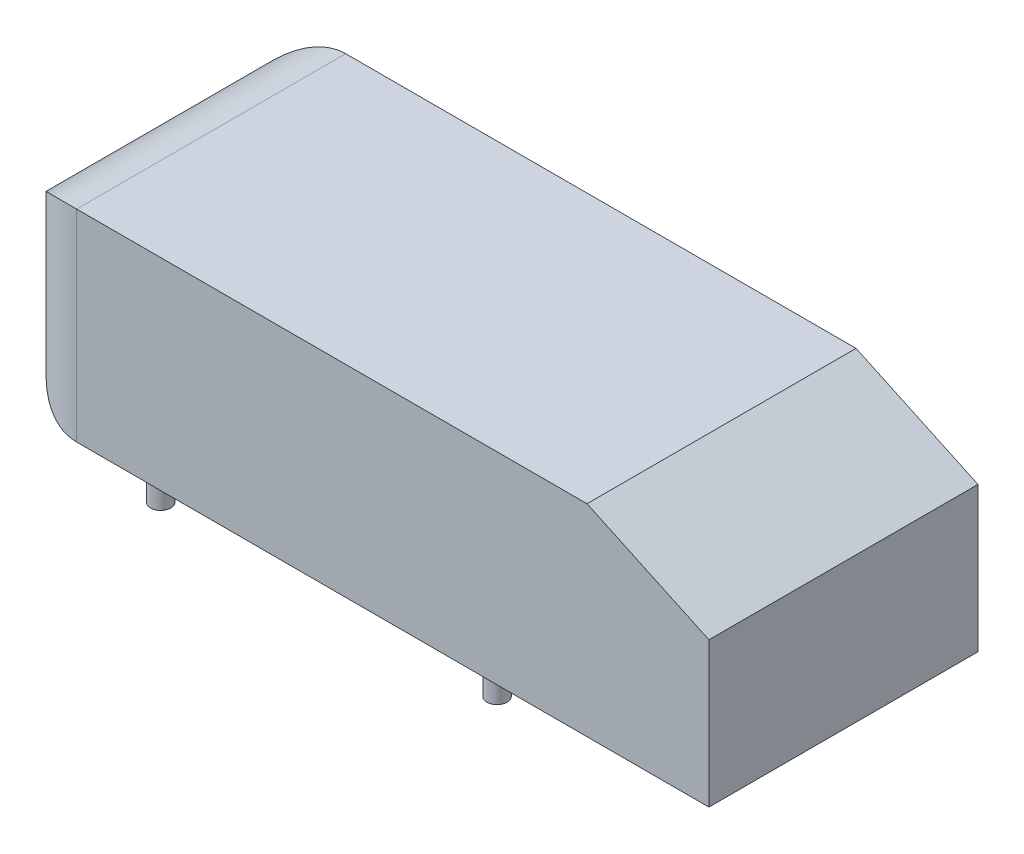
from build123d import *

# Parameters (mm, degrees)
SKETCH3_W               = 400
SKETCH3_H               = 300
BOSS_EXTRUDE1_DEPTH     = 1050
FILLET1_R               = 110
CUT_EXTRUDE1_DEPTH      = 1125.72218792
CUT_EXTRUDE1_DEPTH_BACK = 1125.72218792
SKETCH6_R               = 15
BOSS_EXTRUDE2_DEPTH     = 50


with BuildPart() as part:
    # Sketch3 → Boss-Extrude1 (new body)
    with BuildSketch(Plane(origin=(0, 0, 0), x_dir=(0, 0, -1), z_dir=(1, 0, 0))):
        with Locations((0, 200)):
            Rectangle(SKETCH3_W, SKETCH3_H)
    extrude(amount=-BOSS_EXTRUDE1_DEPTH)

    # Fillet1
    fillet1_edges = [part.edges().sort_by_distance(p)[0] for p in [
        (-1050, 200, -200),
        (-1050, 350, 0),
        (-1050, 200, 200),
        (-1050, 50, 0),
    ]]
    fillet(fillet1_edges, radius=FILLET1_R)

    # Sketch4 → Cut-Extrude1 (cut, two sides: drawn at the far end of the back side and taken through both)
    with BuildSketch(Plane.XY.offset(-CUT_EXTRUDE1_DEPTH_BACK)):
        Polygon((0, 350), (0, 265.476347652), (-181.261557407, 350), align=None)
    extrude(amount=CUT_EXTRUDE1_DEPTH + CUT_EXTRUDE1_DEPTH_BACK, mode=Mode.SUBTRACT)

    # Sketch6 → Boss-Extrude2 (add)
    with BuildSketch(Plane.XZ.offset(-50)):
        with Locations(Location((-850, 165, 0), (0, 0, 270))):
            Circle(SKETCH6_R)
        with Locations(Location((-350, 165, 0), (0, 0, 270))):
            Circle(SKETCH6_R)
        with Locations(Location((-350, -165, 0), (0, 0, 90))):
            Circle(SKETCH6_R)
        with Locations(Location((-850, -165, 0), (0, 0, 90))):
            Circle(SKETCH6_R)
    extrude(amount=BOSS_EXTRUDE2_DEPTH)


solid = part.part
